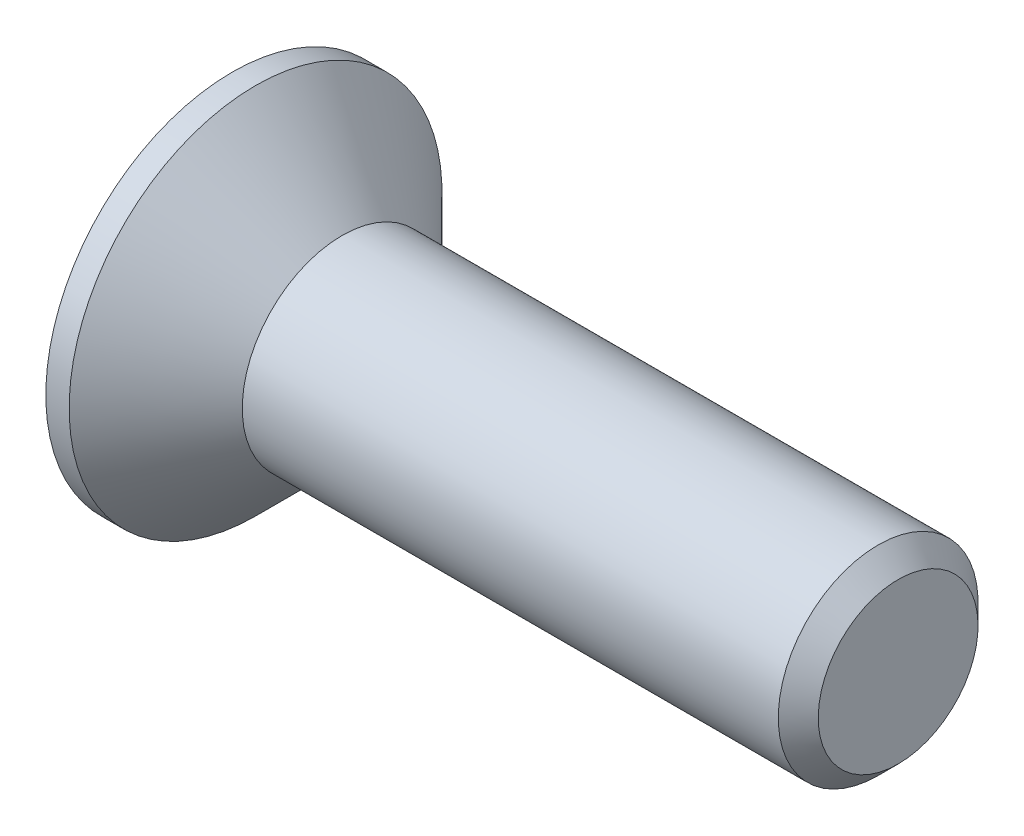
from build123d import *

# Parameters (mm, degrees)
CHAMFER1_SIZE      = 0.3
CUT_EXTRUDE1_DEPTH = 1.25


with BuildPart() as part:
    # Sketch1 → Revolve1 (revolve)
    with BuildSketch(Plane.XY, mode=Mode.PRIVATE) as revolve1_sk:
        Polygon((-1.65, 2.8), (-1.65, 0), (8.35, 0), (8.35, 1.5), (0, 1.5), (-1.3, 2.8), align=None)
    revolve(revolve1_sk.sketch.rotate(Axis((-1.65, 0, 0), (1, 0, 0)), 180), axis=Axis((-1.65, 0, 0), (1, 0, 0)))

    # Chamfer1
    chamfer1_edges = [part.edges().sort_by_distance(p)[0] for p in [
        (8.35, 1.5, 0),
    ]]
    chamfer(chamfer1_edges, length=CHAMFER1_SIZE)

    # Sketch2 → Cut-Extrude1 (cut)
    with BuildSketch(Plane.ZY.offset(1.65)):
        Polygon((-0.365, 1.45), (0.365, 1.45), (0.365, 0.365), (1.45, 0.365), (1.45, -0.365), (0.365, -0.365), (0.365, -1.45), (-0.365, -1.45), (-0.365, -0.365), (-1.45, -0.365), (-1.45, 0.365), (-0.365, 0.365), align=None)
    extrude(amount=-CUT_EXTRUDE1_DEPTH, mode=Mode.SUBTRACT)


solid = part.part
